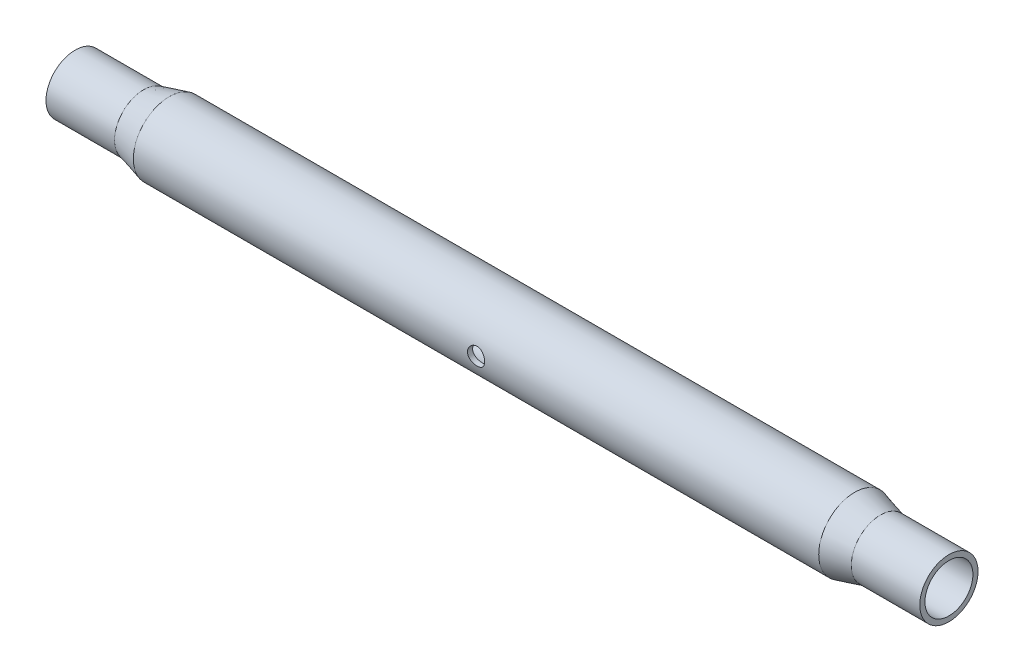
ISO-10303-21;
HEADER;
FILE_DESCRIPTION(('STEP AP214'),'2;1');
FILE_NAME('part.step','',(''),(''),'','','');
FILE_SCHEMA(('AUTOMOTIVE_DESIGN { 1 0 10303 214 1 1 1 1 }'));
ENDSEC;
DATA;
#1=APPLICATION_CONTEXT('core data for automotive mechanical design processes');
#2=APPLICATION_PROTOCOL_DEFINITION('international standard','automotive_design',2000,#1);
#3=PRODUCT_CONTEXT('',#1,'mechanical');
#4=PRODUCT('Part','Part','',(#3));
#5=PRODUCT_RELATED_PRODUCT_CATEGORY('part','',(#4));
#6=PRODUCT_DEFINITION_FORMATION('','',#4);
#7=PRODUCT_DEFINITION_CONTEXT('part definition',#1,'design');
#8=PRODUCT_DEFINITION('design','',#6,#7);
#9=PRODUCT_DEFINITION_SHAPE('','',#8);
#10=(LENGTH_UNIT() NAMED_UNIT(*) SI_UNIT(.MILLI.,.METRE.));
#11=(NAMED_UNIT(*) PLANE_ANGLE_UNIT() SI_UNIT($,.RADIAN.));
#12=(NAMED_UNIT(*) SI_UNIT($,.STERADIAN.) SOLID_ANGLE_UNIT());
#13=UNCERTAINTY_MEASURE_WITH_UNIT(LENGTH_MEASURE(1.E-05),#10,'distance_accuracy_value','');
#14=(GEOMETRIC_REPRESENTATION_CONTEXT(3) GLOBAL_UNCERTAINTY_ASSIGNED_CONTEXT((#13)) GLOBAL_UNIT_ASSIGNED_CONTEXT((#10,
#11,#12)) REPRESENTATION_CONTEXT('',''));
#15=CARTESIAN_POINT('',(0.,0.,0.));
#16=DIRECTION('',(0.,0.,1.));
#17=DIRECTION('',(1.,0.,0.));
#18=AXIS2_PLACEMENT_3D('',#15,#16,#17);
#19=CARTESIAN_POINT('',(-91.8956932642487,0.,0.));
#20=DIRECTION('',(-1.,0.,0.));
#21=DIRECTION('',(0.,0.,0.999999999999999));
#22=AXIS2_PLACEMENT_3D('',#19,#20,#21);
#23=CYLINDRICAL_SURFACE('',#22,14.);
#24=CARTESIAN_POINT('',(442.991527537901,0.,0.));
#25=DIRECTION('',(-1.,0.,0.));
#26=DIRECTION('',(0.,0.,0.999999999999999));
#27=AXIS2_PLACEMENT_3D('',#24,#25,#26);
#28=CIRCLE('',#27,14.);
#29=CARTESIAN_POINT('',(442.991527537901,0.,14.));
#30=VERTEX_POINT('',#29);
#31=EDGE_CURVE('E127',#30,#30,#28,.T.);
#32=ORIENTED_EDGE('',*,*,#31,.F.);
#33=EDGE_LOOP('',(#32));
#34=FACE_BOUND('',#33,.T.);
#35=CARTESIAN_POINT('',(402.598396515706,0.,0.));
#36=DIRECTION('',(-1.,0.,0.));
#37=DIRECTION('',(0.,0.,0.999999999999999));
#38=AXIS2_PLACEMENT_3D('',#35,#36,#37);
#39=CIRCLE('',#38,14.);
#40=CARTESIAN_POINT('',(402.598396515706,0.,14.));
#41=VERTEX_POINT('',#40);
#42=EDGE_CURVE('E10',#41,#41,#39,.T.);
#43=ORIENTED_EDGE('',*,*,#42,.T.);
#44=EDGE_LOOP('',(#43));
#45=FACE_BOUND('',#44,.T.);
#46=ADVANCED_FACE('F32',(#34,#45),#23,.F.);
#47=CARTESIAN_POINT('',(387.598396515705,-2.22044604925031E-13,2.22044604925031E-13));
#48=DIRECTION('',(-1.,0.,0.));
#49=DIRECTION('',(0.,0.,0.999999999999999));
#50=AXIS2_PLACEMENT_3D('',#47,#48,#49);
#51=CONICAL_SURFACE('',#50,18.,0.26060239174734);
#52=ORIENTED_EDGE('',*,*,#42,.F.);
#53=EDGE_LOOP('',(#52));
#54=FACE_BOUND('',#53,.T.);
#55=CARTESIAN_POINT('',(387.598396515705,-2.22044604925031E-13,2.22044604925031E-13));
#56=DIRECTION('',(-1.,0.,0.));
#57=DIRECTION('',(0.,0.,0.999999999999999));
#58=AXIS2_PLACEMENT_3D('',#55,#56,#57);
#59=CIRCLE('',#58,18.);
#60=CARTESIAN_POINT('',(387.598396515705,-2.19817077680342E-13,18.0000000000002));
#61=VERTEX_POINT('',#60);
#62=EDGE_CURVE('E43',#61,#61,#59,.T.);
#63=ORIENTED_EDGE('',*,*,#62,.T.);
#64=EDGE_LOOP('',(#63));
#65=FACE_BOUND('',#64,.T.);
#66=ADVANCED_FACE('F86',(#54,#65),#51,.F.);
#67=CARTESIAN_POINT('',(-91.8956932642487,0.,0.));
#68=DIRECTION('',(-1.,0.,0.));
#69=DIRECTION('',(0.,0.,0.999999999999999));
#70=AXIS2_PLACEMENT_3D('',#67,#68,#69);
#71=CYLINDRICAL_SURFACE('',#70,18.);
#72=CARTESIAN_POINT('',(192.991527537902,0.,17.9999999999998));
#73=CARTESIAN_POINT('',(192.991521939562,0.275205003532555,17.9999963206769));
#74=CARTESIAN_POINT('',(192.968730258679,0.550468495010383,17.9936269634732));
#75=CARTESIAN_POINT('',(192.878344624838,1.09303790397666,17.9688380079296));
#76=CARTESIAN_POINT('',(192.810731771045,1.36034041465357,17.9504133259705));
#77=CARTESIAN_POINT('',(192.633092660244,1.87907979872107,17.9035426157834));
#78=CARTESIAN_POINT('',(192.523123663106,2.13053756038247,17.8751101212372));
#79=CARTESIAN_POINT('',(192.264113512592,2.61144278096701,17.8112125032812));
#80=CARTESIAN_POINT('',(192.115068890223,2.8408882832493,17.7757467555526));
#81=CARTESIAN_POINT('',(191.778209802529,3.27698713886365,17.7006063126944));
#82=CARTESIAN_POINT('',(191.589599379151,3.48301245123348,17.6608549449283));
#83=CARTESIAN_POINT('',(191.180662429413,3.86095274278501,17.5821042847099));
#84=CARTESIAN_POINT('',(190.960331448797,4.03286292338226,17.5431050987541));
#85=CARTESIAN_POINT('',(190.489098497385,4.3408323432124,17.4694817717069));
#86=CARTESIAN_POINT('',(190.237698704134,4.47615499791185,17.4349539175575));
#87=CARTESIAN_POINT('',(189.714599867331,4.70235828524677,17.375316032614));
#88=CARTESIAN_POINT('',(189.442904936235,4.79324789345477,17.3502041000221));
#89=CARTESIAN_POINT('',(188.893916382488,4.9257969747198,17.3130353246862));
#90=CARTESIAN_POINT('',(188.616920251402,4.96860147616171,17.3006754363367));
#91=CARTESIAN_POINT('',(188.059423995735,5.00733708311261,17.2895059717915));
#92=CARTESIAN_POINT('',(187.778924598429,5.00327776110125,17.2906936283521));
#93=CARTESIAN_POINT('',(187.231438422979,4.94930685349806,17.3062146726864));
#94=CARTESIAN_POINT('',(186.964300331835,4.90079609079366,17.3201464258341));
#95=CARTESIAN_POINT('',(186.44211302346,4.76154924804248,17.3589406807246));
#96=CARTESIAN_POINT('',(186.187064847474,4.67080953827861,17.383804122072));
#97=CARTESIAN_POINT('',(185.692718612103,4.44857492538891,17.4420027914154));
#98=CARTESIAN_POINT('',(185.453648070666,4.31660087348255,17.4754367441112));
#99=CARTESIAN_POINT('',(185.000561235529,4.0159776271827,17.5469580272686));
#100=CARTESIAN_POINT('',(184.786550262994,3.84732066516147,17.5850463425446));
#101=CARTESIAN_POINT('',(184.381672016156,3.47102244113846,17.6632428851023));
#102=CARTESIAN_POINT('',(184.191896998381,3.26220911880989,17.7033748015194));
#103=CARTESIAN_POINT('',(183.849824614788,2.81522642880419,17.7799279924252));
#104=CARTESIAN_POINT('',(183.697528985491,2.5770557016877,17.8163490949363));
#105=CARTESIAN_POINT('',(183.434200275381,2.07633371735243,17.8816335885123));
#106=CARTESIAN_POINT('',(183.323379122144,1.81366558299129,17.9104579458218));
#107=CARTESIAN_POINT('',(183.147791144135,1.27243995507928,17.9570197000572));
#108=CARTESIAN_POINT('',(183.083013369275,0.99388625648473,17.9747597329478));
#109=CARTESIAN_POINT('',(183.003098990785,0.438106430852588,17.9967494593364));
#110=CARTESIAN_POINT('',(182.986478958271,0.161109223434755,18.0014021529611));
#111=CARTESIAN_POINT('',(182.999235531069,-0.391719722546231,17.9978592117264));
#112=CARTESIAN_POINT('',(183.028606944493,-0.667551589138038,17.9896650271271));
#113=CARTESIAN_POINT('',(183.131300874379,-1.20482765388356,17.961610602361));
#114=CARTESIAN_POINT('',(183.20378331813,-1.46644515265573,17.9419734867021));
#115=CARTESIAN_POINT('',(183.389655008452,-1.97377247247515,17.8932731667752));
#116=CARTESIAN_POINT('',(183.503048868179,-2.21948049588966,17.8642088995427));
#117=CARTESIAN_POINT('',(183.770191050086,-2.69368056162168,17.798949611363));
#118=CARTESIAN_POINT('',(183.92472963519,-2.9217082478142,17.762618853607));
#119=CARTESIAN_POINT('',(184.268792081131,-3.34911068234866,17.687019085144));
#120=CARTESIAN_POINT('',(184.458323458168,-3.54847925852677,17.6477494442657));
#121=CARTESIAN_POINT('',(184.873933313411,-3.91924810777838,17.5691937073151));
#122=CARTESIAN_POINT('',(185.100957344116,-4.08959831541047,17.5299443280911));
#123=CARTESIAN_POINT('',(185.581210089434,-4.38982325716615,17.4571877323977));
#124=CARTESIAN_POINT('',(185.834437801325,-4.51969953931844,17.4236802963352));
#125=CARTESIAN_POINT('',(186.358756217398,-4.73432423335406,17.3665919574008));
#126=CARTESIAN_POINT('',(186.629738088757,-4.81932309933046,17.3429561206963));
#127=CARTESIAN_POINT('',(187.182926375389,-4.9423060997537,17.3083150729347));
#128=CARTESIAN_POINT('',(187.465129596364,-4.98030351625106,17.2973062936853));
#129=CARTESIAN_POINT('',(188.021950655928,-5.00739439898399,17.2894815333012));
#130=CARTESIAN_POINT('',(188.296480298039,-4.99818284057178,17.2921736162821));
#131=CARTESIAN_POINT('',(188.839907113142,-4.93508573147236,17.310285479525));
#132=CARTESIAN_POINT('',(189.108804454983,-4.88120152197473,17.3257048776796));
#133=CARTESIAN_POINT('',(189.630996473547,-4.73130896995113,17.3672287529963));
#134=CARTESIAN_POINT('',(189.884410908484,-4.63568858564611,17.3932346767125));
#135=CARTESIAN_POINT('',(190.371797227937,-4.40533806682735,17.4529966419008));
#136=CARTESIAN_POINT('',(190.605765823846,-4.27060133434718,17.4867539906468));
#137=CARTESIAN_POINT('',(191.0556381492,-3.96082784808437,17.559552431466));
#138=CARTESIAN_POINT('',(191.270733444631,-3.78464833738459,17.5987271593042));
#139=CARTESIAN_POINT('',(191.668857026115,-3.39912610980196,17.6772332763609));
#140=CARTESIAN_POINT('',(191.851877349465,-3.1897751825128,17.7165647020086));
#141=CARTESIAN_POINT('',(192.184960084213,-2.73784092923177,17.7920735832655));
#142=CARTESIAN_POINT('',(192.334134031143,-2.4945850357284,17.8281536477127));
#143=CARTESIAN_POINT('',(192.589240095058,-1.98544793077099,17.8919989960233));
#144=CARTESIAN_POINT('',(192.695197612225,-1.71958012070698,17.9197691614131));
#145=CARTESIAN_POINT('',(192.848407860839,-1.21258193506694,17.9606429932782));
#146=CARTESIAN_POINT('',(192.901946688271,-0.97345760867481,17.9752898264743));
#147=CARTESIAN_POINT('',(192.97350692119,-0.489570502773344,17.9949693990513));
#148=CARTESIAN_POINT('',(192.991532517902,-0.244808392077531,18.0000032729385));
#149=CARTESIAN_POINT('',(192.991527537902,0.,17.9999999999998));
#150=B_SPLINE_CURVE_WITH_KNOTS('',3,(#72,#73,#74,#75,#76,#77,#78,#79,#80,#81,#82,#83,#84,#85,
#86,#87,#88,#89,#90,#91,#92,#93,#94,#95,#96,#97,#98,#99,#100,#101,#102,#103,#104,#105,#106,#107,
#108,#109,#110,#111,#112,#113,#114,#115,#116,#117,#118,#119,#120,#121,#122,#123,#124,#125,#126,
#127,#128,#129,#130,#131,#132,#133,#134,#135,#136,#137,#138,#139,#140,#141,#142,#143,#144,#145,
#146,#147,#148,#149),.UNSPECIFIED.,.T.,.F.,(4,2,2,2,2,2,2,2,2,2,2,2,2,2,2,2,2,2,2,2,2,2,2,2,2,2,
2,2,2,2,2,2,2,2,2,2,2,2,4),(0.,0.824716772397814,1.64978154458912,2.47373483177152,
3.29776129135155,4.14030497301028,4.98296708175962,5.84150761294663,6.69987464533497,
7.53733727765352,8.37462885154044,9.18640931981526,9.99825957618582,10.8199184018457,
11.6417513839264,12.4927797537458,13.343847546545,14.1992066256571,15.0543622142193,
15.8828804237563,16.7113051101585,17.5240926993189,18.3369719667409,19.1667579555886,
19.9967223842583,20.8522396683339,21.707724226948,22.5583825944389,23.4088005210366,
24.2289039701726,25.0489827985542,25.8615957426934,26.6743458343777,27.5128765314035,
28.3516151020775,29.2103236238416,30.068526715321,30.8022394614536,31.5358656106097),.UNSPECIFIED.);
#151=CARTESIAN_POINT('',(192.991527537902,0.,17.9999999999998));
#152=VERTEX_POINT('',#151);
#153=EDGE_CURVE('E77',#152,#152,#150,.T.);
#154=ORIENTED_EDGE('',*,*,#153,.T.);
#155=EDGE_LOOP('',(#154));
#156=FACE_BOUND('',#155,.T.);
#157=CARTESIAN_POINT('',(192.991527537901,0.,-18.));
#158=CARTESIAN_POINT('',(192.99152193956,-0.275205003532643,-17.9999963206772));
#159=CARTESIAN_POINT('',(192.968730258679,-0.550468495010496,-17.9936269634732));
#160=CARTESIAN_POINT('',(192.878344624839,-1.09303790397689,-17.9688380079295));
#161=CARTESIAN_POINT('',(192.810731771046,-1.3603404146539,-17.9504133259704));
#162=CARTESIAN_POINT('',(192.633092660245,-1.87907979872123,-17.9035426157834));
#163=CARTESIAN_POINT('',(192.523123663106,-2.13053756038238,-17.8751101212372));
#164=CARTESIAN_POINT('',(192.264113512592,-2.61144278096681,-17.8112125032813));
#165=CARTESIAN_POINT('',(192.115068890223,-2.84088828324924,-17.7757467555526));
#166=CARTESIAN_POINT('',(191.778209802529,-3.27698713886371,-17.7006063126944));
#167=CARTESIAN_POINT('',(191.589599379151,-3.48301245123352,-17.6608549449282));
#168=CARTESIAN_POINT('',(191.180662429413,-3.86095274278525,-17.58210428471));
#169=CARTESIAN_POINT('',(190.960331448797,-4.03286292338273,-17.5431050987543));
#170=CARTESIAN_POINT('',(190.489098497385,-4.34083234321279,-17.4694817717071));
#171=CARTESIAN_POINT('',(190.237698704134,-4.47615499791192,-17.4349539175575));
#172=CARTESIAN_POINT('',(189.714599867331,-4.70235828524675,-17.3753160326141));
#173=CARTESIAN_POINT('',(189.442904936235,-4.79324789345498,-17.3502041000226));
#174=CARTESIAN_POINT('',(188.893916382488,-4.92579697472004,-17.3130353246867));
#175=CARTESIAN_POINT('',(188.616920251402,-4.96860147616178,-17.3006754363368));
#176=CARTESIAN_POINT('',(188.059423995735,-5.00733708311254,-17.2895059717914));
#177=CARTESIAN_POINT('',(187.778924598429,-5.00327776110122,-17.2906936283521));
#178=CARTESIAN_POINT('',(187.231438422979,-4.9493068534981,-17.3062146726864));
#179=CARTESIAN_POINT('',(186.964300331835,-4.90079609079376,-17.320146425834));
#180=CARTESIAN_POINT('',(186.442113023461,-4.7615492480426,-17.3589406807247));
#181=CARTESIAN_POINT('',(186.187064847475,-4.6708095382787,-17.3838041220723));
#182=CARTESIAN_POINT('',(185.692718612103,-4.4485749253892,-17.4420027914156));
#183=CARTESIAN_POINT('',(185.453648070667,-4.31660087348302,-17.4754367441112));
#184=CARTESIAN_POINT('',(185.000561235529,-4.01597762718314,-17.5469580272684));
#185=CARTESIAN_POINT('',(184.786550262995,-3.84732066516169,-17.5850463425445));
#186=CARTESIAN_POINT('',(184.381672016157,-3.47102244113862,-17.6632428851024));
#187=CARTESIAN_POINT('',(184.191896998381,-3.26220911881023,-17.7033748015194));
#188=CARTESIAN_POINT('',(183.849824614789,-2.81522642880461,-17.7799279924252));
#189=CARTESIAN_POINT('',(183.697528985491,-2.57705570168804,-17.8163490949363));
#190=CARTESIAN_POINT('',(183.434200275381,-2.07633371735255,-17.8816335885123));
#191=CARTESIAN_POINT('',(183.323379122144,-1.81366558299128,-17.9104579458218));
#192=CARTESIAN_POINT('',(183.147791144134,-1.27243995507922,-17.9570197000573));
#193=CARTESIAN_POINT('',(183.083013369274,-0.993886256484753,-17.9747597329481));
#194=CARTESIAN_POINT('',(183.003098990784,-0.438106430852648,-17.9967494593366));
#195=CARTESIAN_POINT('',(182.986478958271,-0.161109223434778,-18.0014021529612));
#196=CARTESIAN_POINT('',(182.99923553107,0.391719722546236,-17.9978592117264));
#197=CARTESIAN_POINT('',(183.028606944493,0.667551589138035,-17.9896650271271));
#198=CARTESIAN_POINT('',(183.131300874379,1.20482765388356,-17.961610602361));
#199=CARTESIAN_POINT('',(183.20378331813,1.46644515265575,-17.9419734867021));
#200=CARTESIAN_POINT('',(183.389655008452,1.97377247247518,-17.8932731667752));
#201=CARTESIAN_POINT('',(183.503048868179,2.21948049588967,-17.8642088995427));
#202=CARTESIAN_POINT('',(183.770191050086,2.69368056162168,-17.798949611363));
#203=CARTESIAN_POINT('',(183.92472963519,2.92170824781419,-17.762618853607));
#204=CARTESIAN_POINT('',(184.268792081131,3.34911068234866,-17.687019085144));
#205=CARTESIAN_POINT('',(184.458323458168,3.54847925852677,-17.6477494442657));
#206=CARTESIAN_POINT('',(184.873933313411,3.91924810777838,-17.5691937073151));
#207=CARTESIAN_POINT('',(185.100957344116,4.08959831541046,-17.529944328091));
#208=CARTESIAN_POINT('',(185.581210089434,4.38982325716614,-17.4571877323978));
#209=CARTESIAN_POINT('',(185.834437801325,4.51969953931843,-17.4236802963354));
#210=CARTESIAN_POINT('',(186.358756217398,4.73432423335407,-17.366591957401));
#211=CARTESIAN_POINT('',(186.629738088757,4.81932309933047,-17.3429561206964));
#212=CARTESIAN_POINT('',(187.182926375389,4.94230609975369,-17.3083150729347));
#213=CARTESIAN_POINT('',(187.465129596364,4.98030351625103,-17.2973062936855));
#214=CARTESIAN_POINT('',(188.021950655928,5.00739439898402,-17.2894815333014));
#215=CARTESIAN_POINT('',(188.296480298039,4.99818284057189,-17.2921736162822));
#216=CARTESIAN_POINT('',(188.839907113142,4.93508573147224,-17.310285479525));
#217=CARTESIAN_POINT('',(189.108804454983,4.88120152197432,-17.3257048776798));
#218=CARTESIAN_POINT('',(189.630996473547,4.73130896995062,-17.3672287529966));
#219=CARTESIAN_POINT('',(189.884410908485,4.63568858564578,-17.3932346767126));
#220=CARTESIAN_POINT('',(190.371797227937,4.40533806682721,-17.4529966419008));
#221=CARTESIAN_POINT('',(190.605765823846,4.27060133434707,-17.4867539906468));
#222=CARTESIAN_POINT('',(191.0556381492,3.96082784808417,-17.559552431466));
#223=CARTESIAN_POINT('',(191.270733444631,3.78464833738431,-17.5987271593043));
#224=CARTESIAN_POINT('',(191.668857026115,3.39912610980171,-17.6772332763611));
#225=CARTESIAN_POINT('',(191.851877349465,3.18977518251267,-17.7165647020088));
#226=CARTESIAN_POINT('',(192.184960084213,2.73784092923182,-17.7920735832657));
#227=CARTESIAN_POINT('',(192.334134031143,2.49458503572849,-17.8281536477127));
#228=CARTESIAN_POINT('',(192.589240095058,1.98544793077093,-17.8919989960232));
#229=CARTESIAN_POINT('',(192.695197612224,1.71958012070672,-17.9197691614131));
#230=CARTESIAN_POINT('',(192.848407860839,1.21258193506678,-17.9606429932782));
#231=CARTESIAN_POINT('',(192.901946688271,0.973457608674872,-17.9752898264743));
#232=CARTESIAN_POINT('',(192.97350692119,0.489570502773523,-17.9949693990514));
#233=CARTESIAN_POINT('',(192.9915325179,0.244808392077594,-18.0000032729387));
#234=CARTESIAN_POINT('',(192.991527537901,0.,-18.));
#235=B_SPLINE_CURVE_WITH_KNOTS('',3,(#157,#158,#159,#160,#161,#162,#163,#164,#165,#166,#167,
#168,#169,#170,#171,#172,#173,#174,#175,#176,#177,#178,#179,#180,#181,#182,#183,#184,#185,#186,
#187,#188,#189,#190,#191,#192,#193,#194,#195,#196,#197,#198,#199,#200,#201,#202,#203,#204,#205,
#206,#207,#208,#209,#210,#211,#212,#213,#214,#215,#216,#217,#218,#219,#220,#221,#222,#223,#224,
#225,#226,#227,#228,#229,#230,#231,#232,#233,#234),.UNSPECIFIED.,.T.,.F.,(4,2,2,2,2,2,2,2,2,2,2,
2,2,2,2,2,2,2,2,2,2,2,2,2,2,2,2,2,2,2,2,2,2,2,2,2,2,2,4),(0.,0.8247167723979,1.64978154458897,
2.4737348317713,3.29776129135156,4.14030497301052,4.98296708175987,5.84150761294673,
6.69987464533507,7.53733727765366,8.37462885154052,9.18640931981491,9.99825957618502,
10.819918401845,11.6417513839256,12.4927797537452,13.3438475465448,14.1992066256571,
15.0543622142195,15.8828804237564,16.7113051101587,17.5240926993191,18.336971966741,
19.1667579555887,19.9967223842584,20.8522396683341,21.7077242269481,22.5583825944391,
23.4088005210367,24.2289039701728,25.0489827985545,25.861595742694,26.6743458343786,
27.512876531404,28.3516151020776,29.2103236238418,30.068526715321,30.8022394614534,
31.5358656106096),.UNSPECIFIED.);
#236=CARTESIAN_POINT('',(192.991527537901,0.,-18.));
#237=VERTEX_POINT('',#236);
#238=EDGE_CURVE('E72',#237,#237,#235,.T.);
#239=ORIENTED_EDGE('',*,*,#238,.T.);
#240=EDGE_LOOP('',(#239));
#241=FACE_BOUND('',#240,.T.);
#242=ORIENTED_EDGE('',*,*,#62,.F.);
#243=EDGE_LOOP('',(#242));
#244=FACE_BOUND('',#243,.T.);
#245=CARTESIAN_POINT('',(-11.6153414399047,-2.22044604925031E-13,0.));
#246=DIRECTION('',(-1.,0.,0.));
#247=DIRECTION('',(0.,0.,0.999999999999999));
#248=AXIS2_PLACEMENT_3D('',#245,#246,#247);
#249=CIRCLE('',#248,18.);
#250=CARTESIAN_POINT('',(-11.6153414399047,-2.19817077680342E-13,18.));
#251=VERTEX_POINT('',#250);
#252=EDGE_CURVE('E48',#251,#251,#249,.T.);
#253=ORIENTED_EDGE('',*,*,#252,.T.);
#254=EDGE_LOOP('',(#253));
#255=FACE_BOUND('',#254,.T.);
#256=ADVANCED_FACE('F81',(#156,#241,#244,#255),#71,.F.);
#257=CARTESIAN_POINT('',(-26.6153414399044,0.,0.));
#258=DIRECTION('',(1.,0.,0.));
#259=DIRECTION('',(0.,0.,-0.999999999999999));
#260=AXIS2_PLACEMENT_3D('',#257,#258,#259);
#261=CONICAL_SURFACE('',#260,14.,0.260602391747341);
#262=ORIENTED_EDGE('',*,*,#252,.F.);
#263=EDGE_LOOP('',(#262));
#264=FACE_BOUND('',#263,.T.);
#265=CARTESIAN_POINT('',(-26.6153414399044,0.,0.));
#266=DIRECTION('',(-1.,0.,0.));
#267=DIRECTION('',(0.,0.,0.999999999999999));
#268=AXIS2_PLACEMENT_3D('',#265,#266,#267);
#269=CIRCLE('',#268,14.);
#270=CARTESIAN_POINT('',(-26.6153414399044,0.,14.));
#271=VERTEX_POINT('',#270);
#272=EDGE_CURVE('E103',#271,#271,#269,.T.);
#273=ORIENTED_EDGE('',*,*,#272,.T.);
#274=EDGE_LOOP('',(#273));
#275=FACE_BOUND('',#274,.T.);
#276=ADVANCED_FACE('F85',(#264,#275),#261,.F.);
#277=CARTESIAN_POINT('',(-91.8956932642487,0.,0.));
#278=DIRECTION('',(-1.,0.,0.));
#279=DIRECTION('',(0.,0.,0.999999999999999));
#280=AXIS2_PLACEMENT_3D('',#277,#278,#279);
#281=CYLINDRICAL_SURFACE('',#280,14.);
#282=ORIENTED_EDGE('',*,*,#272,.F.);
#283=EDGE_LOOP('',(#282));
#284=FACE_BOUND('',#283,.T.);
#285=CARTESIAN_POINT('',(-67.0084724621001,0.,0.));
#286=DIRECTION('',(-1.,0.,0.));
#287=DIRECTION('',(0.,0.,0.999999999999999));
#288=AXIS2_PLACEMENT_3D('',#285,#286,#287);
#289=CIRCLE('',#288,14.);
#290=CARTESIAN_POINT('',(-67.0084724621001,0.,14.));
#291=VERTEX_POINT('',#290);
#292=EDGE_CURVE('E105',#291,#291,#289,.T.);
#293=ORIENTED_EDGE('',*,*,#292,.T.);
#294=EDGE_LOOP('',(#293));
#295=FACE_BOUND('',#294,.T.);
#296=ADVANCED_FACE('F167',(#284,#295),#281,.F.);
#297=CARTESIAN_POINT('',(-67.0084724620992,14.,0.));
#298=DIRECTION('',(-1.,0.,0.));
#299=DIRECTION('',(0.,0.,0.999999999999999));
#300=AXIS2_PLACEMENT_3D('',#297,#298,#299);
#301=PLANE('',#300);
#302=CARTESIAN_POINT('',(-67.0084724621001,0.,0.));
#303=DIRECTION('',(-1.,0.,0.));
#304=DIRECTION('',(0.,0.,0.999999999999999));
#305=AXIS2_PLACEMENT_3D('',#302,#303,#304);
#306=CIRCLE('',#305,17.);
#307=CARTESIAN_POINT('',(-67.0084724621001,0.,17.));
#308=VERTEX_POINT('',#307);
#309=EDGE_CURVE('E110',#308,#308,#306,.T.);
#310=ORIENTED_EDGE('',*,*,#309,.T.);
#311=EDGE_LOOP('',(#310));
#312=FACE_BOUND('',#311,.T.);
#313=ORIENTED_EDGE('',*,*,#292,.F.);
#314=EDGE_LOOP('',(#313));
#315=FACE_BOUND('',#314,.T.);
#316=ADVANCED_FACE('F161',(#312,#315),#301,.T.);
#317=CARTESIAN_POINT('',(-91.8956932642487,0.,0.));
#318=DIRECTION('',(-1.,0.,0.));
#319=DIRECTION('',(0.,0.,0.999999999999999));
#320=AXIS2_PLACEMENT_3D('',#317,#318,#319);
#321=CYLINDRICAL_SURFACE('',#320,17.);
#322=CARTESIAN_POINT('',(-27.0084724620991,0.,-2.22044604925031E-13));
#323=DIRECTION('',(-1.,0.,0.));
#324=DIRECTION('',(0.,0.,0.999999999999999));
#325=AXIS2_PLACEMENT_3D('',#322,#323,#324);
#326=CIRCLE('',#325,17.);
#327=CARTESIAN_POINT('',(-27.0084724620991,0.,16.9999999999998));
#328=VERTEX_POINT('',#327);
#329=EDGE_CURVE('E113',#328,#328,#326,.T.);
#330=ORIENTED_EDGE('',*,*,#329,.T.);
#331=EDGE_LOOP('',(#330));
#332=FACE_BOUND('',#331,.T.);
#333=ORIENTED_EDGE('',*,*,#309,.F.);
#334=EDGE_LOOP('',(#333));
#335=FACE_BOUND('',#334,.T.);
#336=ADVANCED_FACE('F156',(#332,#335),#321,.T.);
#337=CARTESIAN_POINT('',(-27.0084724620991,0.,-2.22044604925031E-13));
#338=DIRECTION('',(1.,0.,0.));
#339=DIRECTION('',(0.,0.,-0.999999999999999));
#340=AXIS2_PLACEMENT_3D('',#337,#338,#339);
#341=CONICAL_SURFACE('',#340,17.,0.260602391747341);
#342=CARTESIAN_POINT('',(-12.0084724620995,0.,0.));
#343=DIRECTION('',(-1.,0.,0.));
#344=DIRECTION('',(0.,0.,0.999999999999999));
#345=AXIS2_PLACEMENT_3D('',#342,#343,#344);
#346=CIRCLE('',#345,21.);
#347=CARTESIAN_POINT('',(-12.0084724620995,0.,21.));
#348=VERTEX_POINT('',#347);
#349=EDGE_CURVE('E116',#348,#348,#346,.T.);
#350=ORIENTED_EDGE('',*,*,#349,.T.);
#351=EDGE_LOOP('',(#350));
#352=FACE_BOUND('',#351,.T.);
#353=ORIENTED_EDGE('',*,*,#329,.F.);
#354=EDGE_LOOP('',(#353));
#355=FACE_BOUND('',#354,.T.);
#356=ADVANCED_FACE('F148',(#352,#355),#341,.T.);
#357=CARTESIAN_POINT('',(-91.8956932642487,0.,0.));
#358=DIRECTION('',(-1.,0.,0.));
#359=DIRECTION('',(0.,0.,0.999999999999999));
#360=AXIS2_PLACEMENT_3D('',#357,#358,#359);
#361=CYLINDRICAL_SURFACE('',#360,21.);
#362=CARTESIAN_POINT('',(192.991527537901,0.,20.9999999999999));
#363=CARTESIAN_POINT('',(192.991519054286,0.276672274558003,20.9999950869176));
#364=CARTESIAN_POINT('',(192.96848588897,0.553442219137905,20.9944774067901));
#365=CARTESIAN_POINT('',(192.877082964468,1.09907770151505,20.9730002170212));
#366=CARTESIAN_POINT('',(192.808684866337,1.36793818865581,20.9570341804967));
#367=CARTESIAN_POINT('',(192.628849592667,1.88979410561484,20.9164321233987));
#368=CARTESIAN_POINT('',(192.517461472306,2.1428072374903,20.8918059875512));
#369=CARTESIAN_POINT('',(192.25497411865,2.62655227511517,20.8365202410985));
#370=CARTESIAN_POINT('',(192.10387446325,2.85728394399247,20.8058605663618));
#371=CARTESIAN_POINT('',(191.763248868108,3.2942596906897,20.7412034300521));
#372=CARTESIAN_POINT('',(191.573117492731,3.50002481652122,20.7071583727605));
#373=CARTESIAN_POINT('',(191.161123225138,3.87706759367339,20.6398911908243));
#374=CARTESIAN_POINT('',(190.93925706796,4.04834169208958,20.6066691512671));
#375=CARTESIAN_POINT('',(190.46644258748,4.35373775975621,20.5443340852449));
#376=CARTESIAN_POINT('',(190.215146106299,4.48733420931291,20.5152817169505));
#377=CARTESIAN_POINT('',(189.69286031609,4.7102065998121,20.4652654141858));
#378=CARTESIAN_POINT('',(189.421873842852,4.79948890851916,20.4443003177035));
#379=CARTESIAN_POINT('',(188.87313976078,4.92958478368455,20.4133198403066));
#380=CARTESIAN_POINT('',(188.595606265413,4.97125443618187,20.403111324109));
#381=CARTESIAN_POINT('',(188.037314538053,5.00760694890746,20.3942210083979));
#382=CARTESIAN_POINT('',(187.756556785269,5.00229670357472,20.3955375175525));
#383=CARTESIAN_POINT('',(187.20626822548,4.94552551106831,20.4093743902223));
#384=CARTESIAN_POINT('',(186.936626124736,4.89507437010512,20.4216495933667));
#385=CARTESIAN_POINT('',(186.409747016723,4.75106000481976,20.455631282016));
#386=CARTESIAN_POINT('',(186.152510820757,4.65749396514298,20.477338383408));
#387=CARTESIAN_POINT('',(185.654986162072,4.42901918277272,20.5279695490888));
#388=CARTESIAN_POINT('',(185.414876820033,4.29373539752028,20.5569586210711));
#389=CARTESIAN_POINT('',(184.960400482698,3.98592814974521,20.6188494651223));
#390=CARTESIAN_POINT('',(184.746037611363,3.81339873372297,20.6517518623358));
#391=CARTESIAN_POINT('',(184.343341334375,3.43072154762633,20.7188021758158));
#392=CARTESIAN_POINT('',(184.155821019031,3.21971896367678,20.752960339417));
#393=CARTESIAN_POINT('',(183.818681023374,2.7688600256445,20.817905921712));
#394=CARTESIAN_POINT('',(183.66906229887,2.52900294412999,20.8486932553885));
#395=CARTESIAN_POINT('',(183.41171322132,2.02615010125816,20.9035591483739));
#396=CARTESIAN_POINT('',(183.304104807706,1.76308965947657,20.9276181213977));
#397=CARTESIAN_POINT('',(183.134855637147,1.22191581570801,20.9661730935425));
#398=CARTESIAN_POINT('',(183.073206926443,0.943805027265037,20.9806707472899));
#399=CARTESIAN_POINT('',(182.998845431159,0.387385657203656,20.9982284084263));
#400=CARTESIAN_POINT('',(182.985024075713,0.109233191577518,21.0015474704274));
#401=CARTESIAN_POINT('',(183.003683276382,-0.445408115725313,20.9971071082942));
#402=CARTESIAN_POINT('',(183.036160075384,-0.721897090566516,20.9893485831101));
#403=CARTESIAN_POINT('',(183.145577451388,-1.26158148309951,20.9637898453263));
#404=CARTESIAN_POINT('',(183.221922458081,-1.52490459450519,20.9461242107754));
#405=CARTESIAN_POINT('',(183.416236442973,-2.03499926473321,20.9027358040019));
#406=CARTESIAN_POINT('',(183.534209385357,-2.28176924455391,20.8770122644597));
#407=CARTESIAN_POINT('',(183.810642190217,-2.75623238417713,20.819732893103));
#408=CARTESIAN_POINT('',(183.969734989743,-2.98354580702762,20.7880882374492));
#409=CARTESIAN_POINT('',(184.323072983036,-3.40864470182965,20.7226320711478));
#410=CARTESIAN_POINT('',(184.5173236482,-3.60642556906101,20.6888202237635));
#411=CARTESIAN_POINT('',(184.940588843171,-3.97134130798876,20.6219225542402));
#412=CARTESIAN_POINT('',(185.170276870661,-4.13770216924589,20.5888692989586));
#413=CARTESIAN_POINT('',(185.654973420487,-4.42950564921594,20.5280730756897));
#414=CARTESIAN_POINT('',(185.909980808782,-4.55495009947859,20.5003298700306));
#415=CARTESIAN_POINT('',(186.436685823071,-4.76045016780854,20.4535871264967));
#416=CARTESIAN_POINT('',(186.708274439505,-4.84077290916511,20.4345362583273));
#417=CARTESIAN_POINT('',(187.261616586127,-4.95448974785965,20.4072662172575));
#418=CARTESIAN_POINT('',(187.543368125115,-4.98789298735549,20.3990449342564));
#419=CARTESIAN_POINT('',(188.101191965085,-5.00637908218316,20.3945149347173));
#420=CARTESIAN_POINT('',(188.377221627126,-4.99269483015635,20.3979022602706));
#421=CARTESIAN_POINT('',(188.92291761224,-4.92019018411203,20.4155111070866));
#422=CARTESIAN_POINT('',(189.192584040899,-4.86137053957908,20.4297324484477));
#423=CARTESIAN_POINT('',(189.716701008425,-4.70090846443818,20.4672456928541));
#424=CARTESIAN_POINT('',(189.971219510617,-4.59947686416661,20.490492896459));
#425=CARTESIAN_POINT('',(190.459798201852,-4.35684092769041,20.5434488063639));
#426=CARTESIAN_POINT('',(190.693855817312,-4.21563159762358,20.5731583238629));
#427=CARTESIAN_POINT('',(191.140874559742,-3.89349523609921,20.6365744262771));
#428=CARTESIAN_POINT('',(191.353201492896,-3.71170340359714,20.6703592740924));
#429=CARTESIAN_POINT('',(191.744737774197,-3.31527481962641,20.7376300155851));
#430=CARTESIAN_POINT('',(191.923939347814,-3.10063037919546,20.7711158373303));
#431=CARTESIAN_POINT('',(192.246916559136,-2.64044421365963,20.8346538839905));
#432=CARTESIAN_POINT('',(192.390079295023,-2.39446295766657,20.8646425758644));
#433=CARTESIAN_POINT('',(192.632794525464,-1.88124484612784,20.9171515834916));
#434=CARTESIAN_POINT('',(192.732380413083,-1.61402445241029,20.9396776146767));
#435=CARTESIAN_POINT('',(192.86914449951,-1.12247311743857,20.9711168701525));
#436=CARTESIAN_POINT('',(192.914943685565,-0.900618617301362,20.981876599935));
#437=CARTESIAN_POINT('',(192.976137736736,-0.452531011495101,20.9963199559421));
#438=CARTESIAN_POINT('',(192.991534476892,-0.226298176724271,21.0000040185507));
#439=CARTESIAN_POINT('',(192.991527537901,0.,20.9999999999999));
#440=B_SPLINE_CURVE_WITH_KNOTS('',3,(#362,#363,#364,#365,#366,#367,#368,#369,#370,#371,#372,
#373,#374,#375,#376,#377,#378,#379,#380,#381,#382,#383,#384,#385,#386,#387,#388,#389,#390,#391,
#392,#393,#394,#395,#396,#397,#398,#399,#400,#401,#402,#403,#404,#405,#406,#407,#408,#409,#410,
#411,#412,#413,#414,#415,#416,#417,#418,#419,#420,#421,#422,#423,#424,#425,#426,#427,#428,#429,
#430,#431,#432,#433,#434,#435,#436,#437,#438,#439),.UNSPECIFIED.,.T.,.F.,(4,2,2,2,2,2,2,2,2,2,2,
2,2,2,2,2,2,2,2,2,2,2,2,2,2,2,2,2,2,2,2,2,2,2,2,2,2,2,4),(0.,0.829187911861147,1.65889429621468,
2.48765670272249,3.31642791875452,4.15918514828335,5.00202914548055,5.85610518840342,
6.7100584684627,7.54840314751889,8.38662479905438,9.20655158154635,10.0265319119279,
10.8541100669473,11.6818206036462,12.5308602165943,13.3799212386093,14.2314287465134,
15.0827888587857,15.9142784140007,16.7457004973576,17.5660929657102,18.3865635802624,
19.2205051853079,20.054576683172,20.9070840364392,21.7595532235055,22.6069210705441,
23.4541237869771,24.2793148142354,25.1044921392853,25.9256339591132,26.7468789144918,
27.5876572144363,28.4286325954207,29.2830678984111,30.1368472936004,30.815105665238,
31.4933222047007),.UNSPECIFIED.);
#441=CARTESIAN_POINT('',(192.991527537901,0.,20.9999999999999));
#442=VERTEX_POINT('',#441);
#443=EDGE_CURVE('E35',#442,#442,#440,.T.);
#444=ORIENTED_EDGE('',*,*,#443,.F.);
#445=EDGE_LOOP('',(#444));
#446=FACE_BOUND('',#445,.T.);
#447=CARTESIAN_POINT('',(192.991527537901,0.,-20.9999999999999));
#448=CARTESIAN_POINT('',(192.991519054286,-0.276672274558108,-20.9999950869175));
#449=CARTESIAN_POINT('',(192.96848588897,-0.55344221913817,-20.9944774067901));
#450=CARTESIAN_POINT('',(192.877082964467,-1.09907770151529,-20.9730002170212));
#451=CARTESIAN_POINT('',(192.808684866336,-1.36793818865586,-20.9570341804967));
#452=CARTESIAN_POINT('',(192.628849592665,-1.88979410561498,-20.9164321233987));
#453=CARTESIAN_POINT('',(192.517461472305,-2.14280723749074,-20.8918059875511));
#454=CARTESIAN_POINT('',(192.25497411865,-2.62655227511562,-20.8365202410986));
#455=CARTESIAN_POINT('',(192.10387446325,-2.85728394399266,-20.8058605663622));
#456=CARTESIAN_POINT('',(191.763248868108,-3.29425969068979,-20.7412034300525));
#457=CARTESIAN_POINT('',(191.57311749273,-3.50002481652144,-20.7071583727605));
#458=CARTESIAN_POINT('',(191.161123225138,-3.87706759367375,-20.6398911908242));
#459=CARTESIAN_POINT('',(190.93925706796,-4.04834169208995,-20.6066691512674));
#460=CARTESIAN_POINT('',(190.466442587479,-4.35373775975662,-20.5443340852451));
#461=CARTESIAN_POINT('',(190.215146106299,-4.48733420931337,-20.5152817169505));
#462=CARTESIAN_POINT('',(189.692860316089,-4.71020659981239,-20.4652654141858));
#463=CARTESIAN_POINT('',(189.421873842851,-4.79948890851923,-20.4443003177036));
#464=CARTESIAN_POINT('',(188.873139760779,-4.92958478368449,-20.4133198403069));
#465=CARTESIAN_POINT('',(188.595606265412,-4.97125443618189,-20.4031113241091));
#466=CARTESIAN_POINT('',(188.037314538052,-5.00760694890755,-20.3942210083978));
#467=CARTESIAN_POINT('',(187.756556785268,-5.0022967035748,-20.3955375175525));
#468=CARTESIAN_POINT('',(187.206268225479,-4.94552551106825,-20.4093743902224));
#469=CARTESIAN_POINT('',(186.936626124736,-4.89507437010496,-20.4216495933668));
#470=CARTESIAN_POINT('',(186.409747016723,-4.75106000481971,-20.4556312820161));
#471=CARTESIAN_POINT('',(186.152510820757,-4.65749396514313,-20.4773383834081));
#472=CARTESIAN_POINT('',(185.654986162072,-4.42901918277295,-20.5279695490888));
#473=CARTESIAN_POINT('',(185.414876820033,-4.29373539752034,-20.5569586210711));
#474=CARTESIAN_POINT('',(184.960400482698,-3.98592814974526,-20.6188494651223));
#475=CARTESIAN_POINT('',(184.746037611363,-3.81339873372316,-20.6517518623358));
#476=CARTESIAN_POINT('',(184.343341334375,-3.43072154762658,-20.7188021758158));
#477=CARTESIAN_POINT('',(184.155821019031,-3.21971896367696,-20.7529603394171));
#478=CARTESIAN_POINT('',(183.818681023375,-2.76886002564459,-20.817905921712));
#479=CARTESIAN_POINT('',(183.66906229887,-2.52900294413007,-20.8486932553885));
#480=CARTESIAN_POINT('',(183.41171322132,-2.02615010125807,-20.9035591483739));
#481=CARTESIAN_POINT('',(183.304104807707,-1.76308965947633,-20.9276181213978));
#482=CARTESIAN_POINT('',(183.134855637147,-1.22191581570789,-20.9661730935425));
#483=CARTESIAN_POINT('',(183.073206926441,-0.943805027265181,-20.9806707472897));
#484=CARTESIAN_POINT('',(182.998845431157,-0.387385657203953,-20.998228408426));
#485=CARTESIAN_POINT('',(182.985024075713,-0.109233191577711,-21.0015474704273));
#486=CARTESIAN_POINT('',(183.003683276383,0.445408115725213,-20.9971071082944));
#487=CARTESIAN_POINT('',(183.036160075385,0.721897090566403,-20.9893485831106));
#488=CARTESIAN_POINT('',(183.145577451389,1.26158148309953,-20.9637898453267));
#489=CARTESIAN_POINT('',(183.221922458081,1.52490459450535,-20.9461242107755));
#490=CARTESIAN_POINT('',(183.416236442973,2.0349992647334,-20.9027358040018));
#491=CARTESIAN_POINT('',(183.534209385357,2.28176924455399,-20.8770122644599));
#492=CARTESIAN_POINT('',(183.810642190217,2.75623238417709,-20.8197328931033));
#493=CARTESIAN_POINT('',(183.969734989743,2.98354580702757,-20.7880882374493));
#494=CARTESIAN_POINT('',(184.323072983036,3.4086447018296,-20.7226320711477));
#495=CARTESIAN_POINT('',(184.5173236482,3.60642556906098,-20.6888202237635));
#496=CARTESIAN_POINT('',(184.940588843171,3.97134130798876,-20.6219225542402));
#497=CARTESIAN_POINT('',(185.170276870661,4.13770216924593,-20.5888692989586));
#498=CARTESIAN_POINT('',(185.654973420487,4.42950564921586,-20.5280730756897));
#499=CARTESIAN_POINT('',(185.909980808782,4.55495009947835,-20.5003298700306));
#500=CARTESIAN_POINT('',(186.436685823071,4.76045016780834,-20.4535871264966));
#501=CARTESIAN_POINT('',(186.708274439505,4.84077290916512,-20.4345362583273));
#502=CARTESIAN_POINT('',(187.261616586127,4.95448974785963,-20.4072662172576));
#503=CARTESIAN_POINT('',(187.543368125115,4.98789298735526,-20.3990449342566));
#504=CARTESIAN_POINT('',(188.101191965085,5.00637908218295,-20.3945149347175));
#505=CARTESIAN_POINT('',(188.377221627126,4.99269483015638,-20.3979022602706));
#506=CARTESIAN_POINT('',(188.922917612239,4.92019018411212,-20.4155111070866));
#507=CARTESIAN_POINT('',(189.192584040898,4.86137053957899,-20.4297324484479));
#508=CARTESIAN_POINT('',(189.716701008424,4.70090846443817,-20.4672456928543));
#509=CARTESIAN_POINT('',(189.971219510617,4.5994768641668,-20.490492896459));
#510=CARTESIAN_POINT('',(190.459798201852,4.35684092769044,-20.5434488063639));
#511=CARTESIAN_POINT('',(190.693855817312,4.21563159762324,-20.5731583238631));
#512=CARTESIAN_POINT('',(191.140874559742,3.89349523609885,-20.6365744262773));
#513=CARTESIAN_POINT('',(191.353201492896,3.71170340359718,-20.6703592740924));
#514=CARTESIAN_POINT('',(191.744737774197,3.3152748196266,-20.7376300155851));
#515=CARTESIAN_POINT('',(191.923939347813,3.10063037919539,-20.7711158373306));
#516=CARTESIAN_POINT('',(192.246916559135,2.64044421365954,-20.8346538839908));
#517=CARTESIAN_POINT('',(192.390079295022,2.39446295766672,-20.8646425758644));
#518=CARTESIAN_POINT('',(192.632794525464,1.88124484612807,-20.9171515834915));
#519=CARTESIAN_POINT('',(192.732380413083,1.61402445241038,-20.9396776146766));
#520=CARTESIAN_POINT('',(192.86914449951,1.12247311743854,-20.9711168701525));
#521=CARTESIAN_POINT('',(192.914943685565,0.900618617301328,-20.981876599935));
#522=CARTESIAN_POINT('',(192.976137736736,0.45253101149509,-20.9963199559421));
#523=CARTESIAN_POINT('',(192.991534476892,0.226298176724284,-21.0000040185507));
#524=CARTESIAN_POINT('',(192.991527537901,0.,-20.9999999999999));
#525=B_SPLINE_CURVE_WITH_KNOTS('',3,(#447,#448,#449,#450,#451,#452,#453,#454,#455,#456,#457,
#458,#459,#460,#461,#462,#463,#464,#465,#466,#467,#468,#469,#470,#471,#472,#473,#474,#475,#476,
#477,#478,#479,#480,#481,#482,#483,#484,#485,#486,#487,#488,#489,#490,#491,#492,#493,#494,#495,
#496,#497,#498,#499,#500,#501,#502,#503,#504,#505,#506,#507,#508,#509,#510,#511,#512,#513,#514,
#515,#516,#517,#518,#519,#520,#521,#522,#523,#524),.UNSPECIFIED.,.T.,.F.,(4,2,2,2,2,2,2,2,2,2,2,
2,2,2,2,2,2,2,2,2,2,2,2,2,2,2,2,2,2,2,2,2,2,2,2,2,2,2,4),(0.,0.829187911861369,1.65889429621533,
2.48765670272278,3.31642791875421,4.1591851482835,5.00202914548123,5.8561051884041,
6.71005846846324,7.54840314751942,8.38662479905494,9.20655158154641,10.0265319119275,
10.8541100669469,11.6818206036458,12.5308602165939,13.379921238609,14.2314287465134,
15.0827888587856,15.9142784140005,16.7457004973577,17.5660929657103,18.3865635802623,
19.2205051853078,20.0545766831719,20.9070840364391,21.7595532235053,22.606921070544,
23.4541237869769,24.2793148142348,25.1044921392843,25.9256339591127,26.7468789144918,
27.5876572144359,28.4286325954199,29.2830678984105,30.1368472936,30.8151056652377,
31.4933222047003),.UNSPECIFIED.);
#526=CARTESIAN_POINT('',(192.991527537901,0.,-20.9999999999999));
#527=VERTEX_POINT('',#526);
#528=EDGE_CURVE('E51',#527,#527,#525,.T.);
#529=ORIENTED_EDGE('',*,*,#528,.F.);
#530=EDGE_LOOP('',(#529));
#531=FACE_BOUND('',#530,.T.);
#532=CARTESIAN_POINT('',(387.991527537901,0.,0.));
#533=DIRECTION('',(-1.,0.,0.));
#534=DIRECTION('',(0.,0.,0.999999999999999));
#535=AXIS2_PLACEMENT_3D('',#532,#533,#534);
#536=CIRCLE('',#535,21.);
#537=CARTESIAN_POINT('',(387.991527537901,0.,21.));
#538=VERTEX_POINT('',#537);
#539=EDGE_CURVE('E119',#538,#538,#536,.T.);
#540=ORIENTED_EDGE('',*,*,#539,.T.);
#541=EDGE_LOOP('',(#540));
#542=FACE_BOUND('',#541,.T.);
#543=ORIENTED_EDGE('',*,*,#349,.F.);
#544=EDGE_LOOP('',(#543));
#545=FACE_BOUND('',#544,.T.);
#546=ADVANCED_FACE('F55',(#446,#531,#542,#545),#361,.T.);
#547=CARTESIAN_POINT('',(387.991527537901,0.,0.));
#548=DIRECTION('',(-1.,0.,0.));
#549=DIRECTION('',(0.,0.,0.999999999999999));
#550=AXIS2_PLACEMENT_3D('',#547,#548,#549);
#551=CONICAL_SURFACE('',#550,21.,0.260602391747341);
#552=CARTESIAN_POINT('',(402.991527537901,0.,0.));
#553=DIRECTION('',(-1.,0.,0.));
#554=DIRECTION('',(0.,0.,0.999999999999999));
#555=AXIS2_PLACEMENT_3D('',#552,#553,#554);
#556=CIRCLE('',#555,17.);
#557=CARTESIAN_POINT('',(402.991527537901,0.,17.));
#558=VERTEX_POINT('',#557);
#559=EDGE_CURVE('E122',#558,#558,#556,.T.);
#560=ORIENTED_EDGE('',*,*,#559,.T.);
#561=EDGE_LOOP('',(#560));
#562=FACE_BOUND('',#561,.T.);
#563=ORIENTED_EDGE('',*,*,#539,.F.);
#564=EDGE_LOOP('',(#563));
#565=FACE_BOUND('',#564,.T.);
#566=ADVANCED_FACE('F147',(#562,#565),#551,.T.);
#567=CARTESIAN_POINT('',(-91.8956932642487,0.,0.));
#568=DIRECTION('',(-1.,0.,0.));
#569=DIRECTION('',(0.,0.,0.999999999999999));
#570=AXIS2_PLACEMENT_3D('',#567,#568,#569);
#571=CYLINDRICAL_SURFACE('',#570,17.);
#572=CARTESIAN_POINT('',(442.991527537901,0.,0.));
#573=DIRECTION('',(-1.,0.,0.));
#574=DIRECTION('',(0.,0.,0.999999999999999));
#575=AXIS2_PLACEMENT_3D('',#572,#573,#574);
#576=CIRCLE('',#575,17.);
#577=CARTESIAN_POINT('',(442.991527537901,0.,17.));
#578=VERTEX_POINT('',#577);
#579=EDGE_CURVE('E125',#578,#578,#576,.T.);
#580=ORIENTED_EDGE('',*,*,#579,.T.);
#581=EDGE_LOOP('',(#580));
#582=FACE_BOUND('',#581,.T.);
#583=ORIENTED_EDGE('',*,*,#559,.F.);
#584=EDGE_LOOP('',(#583));
#585=FACE_BOUND('',#584,.T.);
#586=ADVANCED_FACE('F142',(#582,#585),#571,.T.);
#587=CARTESIAN_POINT('',(442.991527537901,16.9999999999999,0.));
#588=DIRECTION('',(1.,0.,0.));
#589=DIRECTION('',(0.,0.,-0.999999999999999));
#590=AXIS2_PLACEMENT_3D('',#587,#588,#589);
#591=PLANE('',#590);
#592=ORIENTED_EDGE('',*,*,#31,.T.);
#593=EDGE_LOOP('',(#592));
#594=FACE_BOUND('',#593,.T.);
#595=ORIENTED_EDGE('',*,*,#579,.F.);
#596=EDGE_LOOP('',(#595));
#597=FACE_BOUND('',#596,.T.);
#598=ADVANCED_FACE('F65',(#594,#597),#591,.T.);
#599=CARTESIAN_POINT('',(187.9915275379,0.,-30.));
#600=DIRECTION('',(0.,0.,0.999999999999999));
#601=DIRECTION('',(1.,0.,0.));
#602=AXIS2_PLACEMENT_3D('',#599,#600,#601);
#603=CYLINDRICAL_SURFACE('',#602,4.99999999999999);
#604=ORIENTED_EDGE('',*,*,#528,.T.);
#605=EDGE_LOOP('',(#604));
#606=FACE_BOUND('',#605,.T.);
#607=ORIENTED_EDGE('',*,*,#238,.F.);
#608=EDGE_LOOP('',(#607));
#609=FACE_BOUND('',#608,.T.);
#610=ADVANCED_FACE('F63',(#606,#609),#603,.F.);
#611=ORIENTED_EDGE('',*,*,#443,.T.);
#612=EDGE_LOOP('',(#611));
#613=FACE_BOUND('',#612,.T.);
#614=ORIENTED_EDGE('',*,*,#153,.F.);
#615=EDGE_LOOP('',(#614));
#616=FACE_BOUND('',#615,.T.);
#617=ADVANCED_FACE('F59',(#613,#616),#603,.F.);
#618=CLOSED_SHELL('',(#46,#66,#256,#276,#296,#316,#336,#356,#546,#566,#586,#598,#610,#617));
#619=MANIFOLD_SOLID_BREP('B2',#618);
#620=ADVANCED_BREP_SHAPE_REPRESENTATION('',(#18,#619),#14);
#621=SHAPE_DEFINITION_REPRESENTATION(#9,#620);
ENDSEC;
END-ISO-10303-21;
